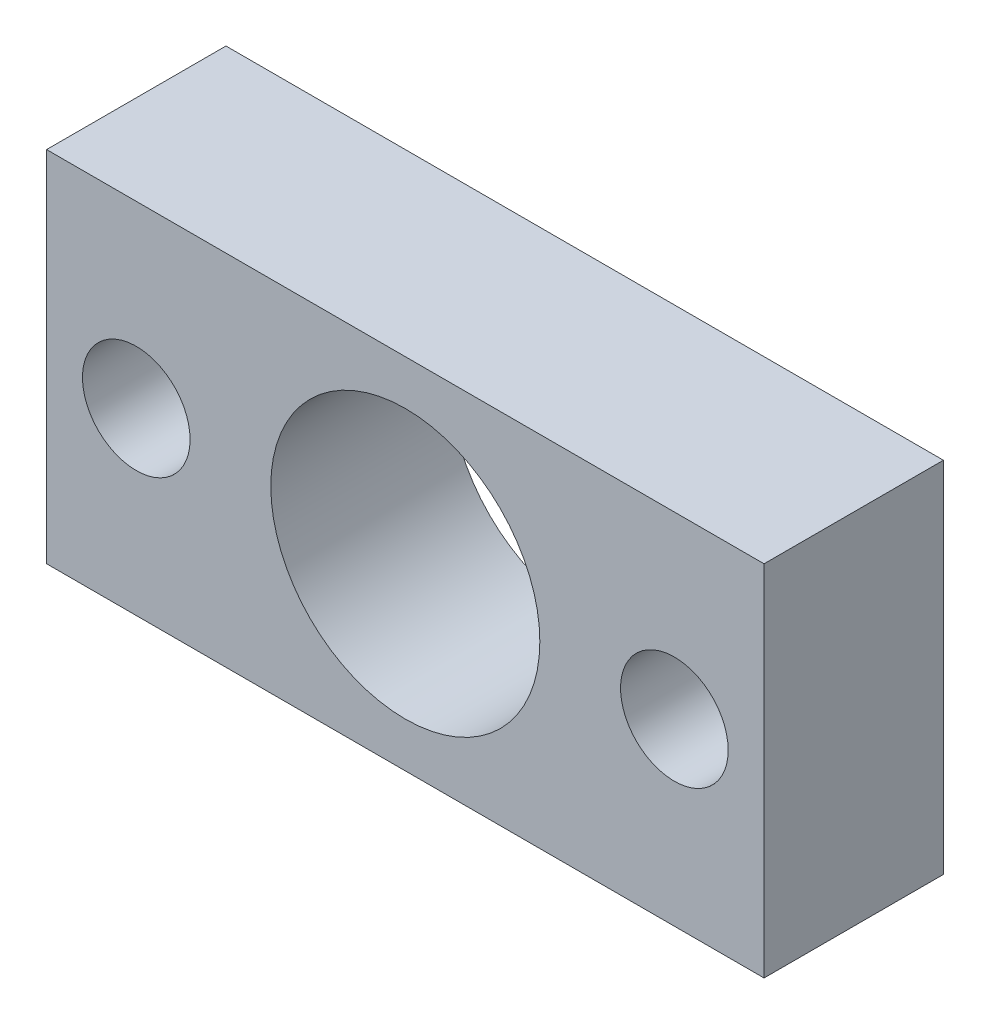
ISO-10303-21;
HEADER;
FILE_DESCRIPTION(('STEP AP214'),'2;1');
FILE_NAME('part.step','',(''),(''),'','','');
FILE_SCHEMA(('AUTOMOTIVE_DESIGN { 1 0 10303 214 1 1 1 1 }'));
ENDSEC;
DATA;
#1=APPLICATION_CONTEXT('core data for automotive mechanical design processes');
#2=APPLICATION_PROTOCOL_DEFINITION('international standard','automotive_design',2000,#1);
#3=PRODUCT_CONTEXT('',#1,'mechanical');
#4=PRODUCT('Part','Part','',(#3));
#5=PRODUCT_RELATED_PRODUCT_CATEGORY('part','',(#4));
#6=PRODUCT_DEFINITION_FORMATION('','',#4);
#7=PRODUCT_DEFINITION_CONTEXT('part definition',#1,'design');
#8=PRODUCT_DEFINITION('design','',#6,#7);
#9=PRODUCT_DEFINITION_SHAPE('','',#8);
#10=(LENGTH_UNIT() NAMED_UNIT(*) SI_UNIT(.MILLI.,.METRE.));
#11=(NAMED_UNIT(*) PLANE_ANGLE_UNIT() SI_UNIT($,.RADIAN.));
#12=(NAMED_UNIT(*) SI_UNIT($,.STERADIAN.) SOLID_ANGLE_UNIT());
#13=UNCERTAINTY_MEASURE_WITH_UNIT(LENGTH_MEASURE(1.E-05),#10,'distance_accuracy_value','');
#14=(GEOMETRIC_REPRESENTATION_CONTEXT(3) GLOBAL_UNCERTAINTY_ASSIGNED_CONTEXT((#13)) GLOBAL_UNIT_ASSIGNED_CONTEXT((#10,
#11,#12)) REPRESENTATION_CONTEXT('',''));
#15=CARTESIAN_POINT('',(0.,0.,0.));
#16=DIRECTION('',(0.,0.,1.));
#17=DIRECTION('',(1.,0.,0.));
#18=AXIS2_PLACEMENT_3D('',#15,#16,#17);
#19=CARTESIAN_POINT('',(25.4,0.,-6.35));
#20=DIRECTION('',(0.,0.,-1.));
#21=DIRECTION('',(-1.,0.,0.));
#22=AXIS2_PLACEMENT_3D('',#19,#20,#21);
#23=PLANE('',#22);
#24=CARTESIAN_POINT('',(22.225,6.35,-6.35));
#25=DIRECTION('',(0.,0.,1.));
#26=DIRECTION('',(1.,0.,0.));
#27=AXIS2_PLACEMENT_3D('',#24,#25,#26);
#28=CIRCLE('',#27,1.905);
#29=CARTESIAN_POINT('',(24.13,6.35,-6.35));
#30=VERTEX_POINT('',#29);
#31=EDGE_CURVE('E87',#30,#30,#28,.T.);
#32=ORIENTED_EDGE('',*,*,#31,.T.);
#33=EDGE_LOOP('',(#32));
#34=FACE_BOUND('',#33,.T.);
#35=CARTESIAN_POINT('',(3.175,6.35,-6.35));
#36=DIRECTION('',(0.,0.,1.));
#37=DIRECTION('',(1.,0.,0.));
#38=AXIS2_PLACEMENT_3D('',#35,#36,#37);
#39=CIRCLE('',#38,1.905);
#40=CARTESIAN_POINT('',(5.08,6.35,-6.35));
#41=VERTEX_POINT('',#40);
#42=EDGE_CURVE('E90',#41,#41,#39,.T.);
#43=ORIENTED_EDGE('',*,*,#42,.T.);
#44=EDGE_LOOP('',(#43));
#45=FACE_BOUND('',#44,.T.);
#46=CARTESIAN_POINT('',(12.7,6.35,-6.35));
#47=DIRECTION('',(0.,0.,1.));
#48=DIRECTION('',(1.,0.,0.));
#49=AXIS2_PLACEMENT_3D('',#46,#47,#48);
#50=CIRCLE('',#49,4.7625);
#51=CARTESIAN_POINT('',(17.4625,6.35,-6.35));
#52=VERTEX_POINT('',#51);
#53=EDGE_CURVE('E20',#52,#52,#50,.T.);
#54=ORIENTED_EDGE('',*,*,#53,.T.);
#55=EDGE_LOOP('',(#54));
#56=FACE_BOUND('',#55,.T.);
#57=DIRECTION('',(0.,1.,0.));
#58=VECTOR('',#57,1.);
#59=CARTESIAN_POINT('',(25.4,0.,-6.35));
#60=LINE('',#59,#58);
#61=CARTESIAN_POINT('',(25.4,0.,-6.35));
#62=VERTEX_POINT('',#61);
#63=CARTESIAN_POINT('',(25.4,12.7,-6.35));
#64=VERTEX_POINT('',#63);
#65=EDGE_CURVE('E61',#62,#64,#60,.T.);
#66=ORIENTED_EDGE('',*,*,#65,.F.);
#67=DIRECTION('',(1.,0.,0.));
#68=VECTOR('',#67,1.);
#69=CARTESIAN_POINT('',(0.,0.,-6.35));
#70=LINE('',#69,#68);
#71=CARTESIAN_POINT('',(0.,0.,-6.35));
#72=VERTEX_POINT('',#71);
#73=EDGE_CURVE('E97',#62,#72,#70,.F.);
#74=ORIENTED_EDGE('',*,*,#73,.T.);
#75=DIRECTION('',(0.,1.,0.));
#76=VECTOR('',#75,1.);
#77=CARTESIAN_POINT('',(0.,0.,-6.35));
#78=LINE('',#77,#76);
#79=CARTESIAN_POINT('',(0.,12.7,-6.35));
#80=VERTEX_POINT('',#79);
#81=EDGE_CURVE('E70',#80,#72,#78,.F.);
#82=ORIENTED_EDGE('',*,*,#81,.F.);
#83=DIRECTION('',(1.,0.,0.));
#84=VECTOR('',#83,1.);
#85=CARTESIAN_POINT('',(0.,12.7,-6.35));
#86=LINE('',#85,#84);
#87=EDGE_CURVE('E56',#64,#80,#86,.F.);
#88=ORIENTED_EDGE('',*,*,#87,.F.);
#89=EDGE_LOOP('',(#66,#74,#82,#88));
#90=FACE_BOUND('',#89,.T.);
#91=ADVANCED_FACE('F17',(#34,#45,#56,#90),#23,.T.);
#92=CARTESIAN_POINT('',(25.4,0.,0.));
#93=DIRECTION('',(1.,0.,0.));
#94=DIRECTION('',(0.,0.,-1.));
#95=AXIS2_PLACEMENT_3D('',#92,#93,#94);
#96=PLANE('',#95);
#97=DIRECTION('',(0.,1.,0.));
#98=VECTOR('',#97,1.);
#99=CARTESIAN_POINT('',(25.4,0.,0.));
#100=LINE('',#99,#98);
#101=CARTESIAN_POINT('',(25.4,0.,0.));
#102=VERTEX_POINT('',#101);
#103=CARTESIAN_POINT('',(25.4,12.7,0.));
#104=VERTEX_POINT('',#103);
#105=EDGE_CURVE('E89',#102,#104,#100,.T.);
#106=ORIENTED_EDGE('',*,*,#105,.F.);
#107=DIRECTION('',(0.,0.,1.));
#108=VECTOR('',#107,1.);
#109=CARTESIAN_POINT('',(25.4,0.,0.));
#110=LINE('',#109,#108);
#111=EDGE_CURVE('E66',#102,#62,#110,.F.);
#112=ORIENTED_EDGE('',*,*,#111,.T.);
#113=ORIENTED_EDGE('',*,*,#65,.T.);
#114=DIRECTION('',(0.,0.,1.));
#115=VECTOR('',#114,1.);
#116=CARTESIAN_POINT('',(25.4,12.7,0.));
#117=LINE('',#116,#115);
#118=EDGE_CURVE('E63',#104,#64,#117,.F.);
#119=ORIENTED_EDGE('',*,*,#118,.F.);
#120=EDGE_LOOP('',(#106,#112,#113,#119));
#121=FACE_BOUND('',#120,.T.);
#122=ADVANCED_FACE('F62',(#121),#96,.T.);
#123=CARTESIAN_POINT('',(0.,12.7,0.));
#124=DIRECTION('',(0.,1.,0.));
#125=DIRECTION('',(0.,0.,1.));
#126=AXIS2_PLACEMENT_3D('',#123,#124,#125);
#127=PLANE('',#126);
#128=DIRECTION('',(0.,0.,1.));
#129=VECTOR('',#128,1.);
#130=CARTESIAN_POINT('',(0.,12.7,-6.35));
#131=LINE('',#130,#129);
#132=CARTESIAN_POINT('',(0.,12.7,0.));
#133=VERTEX_POINT('',#132);
#134=EDGE_CURVE('E72',#133,#80,#131,.F.);
#135=ORIENTED_EDGE('',*,*,#134,.F.);
#136=DIRECTION('',(1.,0.,0.));
#137=VECTOR('',#136,1.);
#138=CARTESIAN_POINT('',(0.,12.7,0.));
#139=LINE('',#138,#137);
#140=EDGE_CURVE('E76',#104,#133,#139,.F.);
#141=ORIENTED_EDGE('',*,*,#140,.F.);
#142=ORIENTED_EDGE('',*,*,#118,.T.);
#143=ORIENTED_EDGE('',*,*,#87,.T.);
#144=EDGE_LOOP('',(#135,#141,#142,#143));
#145=FACE_BOUND('',#144,.T.);
#146=ADVANCED_FACE('F74',(#145),#127,.T.);
#147=CARTESIAN_POINT('',(0.,0.,-6.35));
#148=DIRECTION('',(-1.,0.,0.));
#149=DIRECTION('',(0.,0.,1.));
#150=AXIS2_PLACEMENT_3D('',#147,#148,#149);
#151=PLANE('',#150);
#152=ORIENTED_EDGE('',*,*,#81,.T.);
#153=DIRECTION('',(0.,0.,1.));
#154=VECTOR('',#153,1.);
#155=CARTESIAN_POINT('',(0.,0.,0.));
#156=LINE('',#155,#154);
#157=CARTESIAN_POINT('',(0.,0.,0.));
#158=VERTEX_POINT('',#157);
#159=EDGE_CURVE('E35',#72,#158,#156,.T.);
#160=ORIENTED_EDGE('',*,*,#159,.T.);
#161=DIRECTION('',(0.,1.,0.));
#162=VECTOR('',#161,1.);
#163=CARTESIAN_POINT('',(0.,0.,0.));
#164=LINE('',#163,#162);
#165=EDGE_CURVE('E106',#133,#158,#164,.F.);
#166=ORIENTED_EDGE('',*,*,#165,.F.);
#167=ORIENTED_EDGE('',*,*,#134,.T.);
#168=EDGE_LOOP('',(#152,#160,#166,#167));
#169=FACE_BOUND('',#168,.T.);
#170=ADVANCED_FACE('F104',(#169),#151,.T.);
#171=CARTESIAN_POINT('',(0.,0.,0.));
#172=DIRECTION('',(0.,1.,0.));
#173=DIRECTION('',(0.,0.,1.));
#174=AXIS2_PLACEMENT_3D('',#171,#172,#173);
#175=PLANE('',#174);
#176=ORIENTED_EDGE('',*,*,#73,.F.);
#177=ORIENTED_EDGE('',*,*,#111,.F.);
#178=DIRECTION('',(1.,0.,0.));
#179=VECTOR('',#178,1.);
#180=CARTESIAN_POINT('',(0.,0.,0.));
#181=LINE('',#180,#179);
#182=EDGE_CURVE('E86',#158,#102,#181,.T.);
#183=ORIENTED_EDGE('',*,*,#182,.F.);
#184=ORIENTED_EDGE('',*,*,#159,.F.);
#185=EDGE_LOOP('',(#176,#177,#183,#184));
#186=FACE_BOUND('',#185,.T.);
#187=ADVANCED_FACE('F113',(#186),#175,.F.);
#188=CARTESIAN_POINT('',(12.7,6.35,-6.35));
#189=DIRECTION('',(0.,0.,1.));
#190=DIRECTION('',(1.,0.,0.));
#191=AXIS2_PLACEMENT_3D('',#188,#189,#190);
#192=CYLINDRICAL_SURFACE('',#191,4.7625);
#193=ORIENTED_EDGE('',*,*,#53,.F.);
#194=EDGE_LOOP('',(#193));
#195=FACE_BOUND('',#194,.T.);
#196=CARTESIAN_POINT('',(12.7,6.35,0.));
#197=DIRECTION('',(0.,0.,1.));
#198=DIRECTION('',(1.,0.,0.));
#199=AXIS2_PLACEMENT_3D('',#196,#197,#198);
#200=CIRCLE('',#199,4.7625);
#201=CARTESIAN_POINT('',(17.4625,6.35,0.));
#202=VERTEX_POINT('',#201);
#203=EDGE_CURVE('E83',#202,#202,#200,.F.);
#204=ORIENTED_EDGE('',*,*,#203,.F.);
#205=EDGE_LOOP('',(#204));
#206=FACE_BOUND('',#205,.T.);
#207=ADVANCED_FACE('F115',(#195,#206),#192,.F.);
#208=CARTESIAN_POINT('',(3.175,6.35,-6.35));
#209=DIRECTION('',(0.,0.,1.));
#210=DIRECTION('',(1.,0.,0.));
#211=AXIS2_PLACEMENT_3D('',#208,#209,#210);
#212=CYLINDRICAL_SURFACE('',#211,1.905);
#213=ORIENTED_EDGE('',*,*,#42,.F.);
#214=EDGE_LOOP('',(#213));
#215=FACE_BOUND('',#214,.T.);
#216=CARTESIAN_POINT('',(3.175,6.35,0.));
#217=DIRECTION('',(0.,0.,1.));
#218=DIRECTION('',(1.,0.,0.));
#219=AXIS2_PLACEMENT_3D('',#216,#217,#218);
#220=CIRCLE('',#219,1.905);
#221=CARTESIAN_POINT('',(5.08,6.35,0.));
#222=VERTEX_POINT('',#221);
#223=EDGE_CURVE('E26',#222,#222,#220,.F.);
#224=ORIENTED_EDGE('',*,*,#223,.F.);
#225=EDGE_LOOP('',(#224));
#226=FACE_BOUND('',#225,.T.);
#227=ADVANCED_FACE('F122',(#215,#226),#212,.F.);
#228=CARTESIAN_POINT('',(22.225,6.35,-6.35));
#229=DIRECTION('',(0.,0.,1.));
#230=DIRECTION('',(1.,0.,0.));
#231=AXIS2_PLACEMENT_3D('',#228,#229,#230);
#232=CYLINDRICAL_SURFACE('',#231,1.905);
#233=ORIENTED_EDGE('',*,*,#31,.F.);
#234=EDGE_LOOP('',(#233));
#235=FACE_BOUND('',#234,.T.);
#236=CARTESIAN_POINT('',(22.225,6.35,0.));
#237=DIRECTION('',(0.,0.,1.));
#238=DIRECTION('',(1.,0.,0.));
#239=AXIS2_PLACEMENT_3D('',#236,#237,#238);
#240=CIRCLE('',#239,1.905);
#241=CARTESIAN_POINT('',(24.13,6.35,0.));
#242=VERTEX_POINT('',#241);
#243=EDGE_CURVE('E11',#242,#242,#240,.F.);
#244=ORIENTED_EDGE('',*,*,#243,.F.);
#245=EDGE_LOOP('',(#244));
#246=FACE_BOUND('',#245,.T.);
#247=ADVANCED_FACE('F127',(#235,#246),#232,.F.);
#248=CARTESIAN_POINT('',(0.,0.,0.));
#249=DIRECTION('',(0.,0.,1.));
#250=DIRECTION('',(1.,0.,0.));
#251=AXIS2_PLACEMENT_3D('',#248,#249,#250);
#252=PLANE('',#251);
#253=ORIENTED_EDGE('',*,*,#243,.T.);
#254=EDGE_LOOP('',(#253));
#255=FACE_BOUND('',#254,.T.);
#256=ORIENTED_EDGE('',*,*,#223,.T.);
#257=EDGE_LOOP('',(#256));
#258=FACE_BOUND('',#257,.T.);
#259=ORIENTED_EDGE('',*,*,#203,.T.);
#260=EDGE_LOOP('',(#259));
#261=FACE_BOUND('',#260,.T.);
#262=ORIENTED_EDGE('',*,*,#165,.T.);
#263=ORIENTED_EDGE('',*,*,#182,.T.);
#264=ORIENTED_EDGE('',*,*,#105,.T.);
#265=ORIENTED_EDGE('',*,*,#140,.T.);
#266=EDGE_LOOP('',(#262,#263,#264,#265));
#267=FACE_BOUND('',#266,.T.);
#268=ADVANCED_FACE('F110',(#255,#258,#261,#267),#252,.T.);
#269=CLOSED_SHELL('',(#91,#122,#146,#170,#187,#207,#227,#247,#268));
#270=MANIFOLD_SOLID_BREP('B1',#269);
#271=ADVANCED_BREP_SHAPE_REPRESENTATION('',(#18,#270),#14);
#272=SHAPE_DEFINITION_REPRESENTATION(#9,#271);
ENDSEC;
END-ISO-10303-21;
